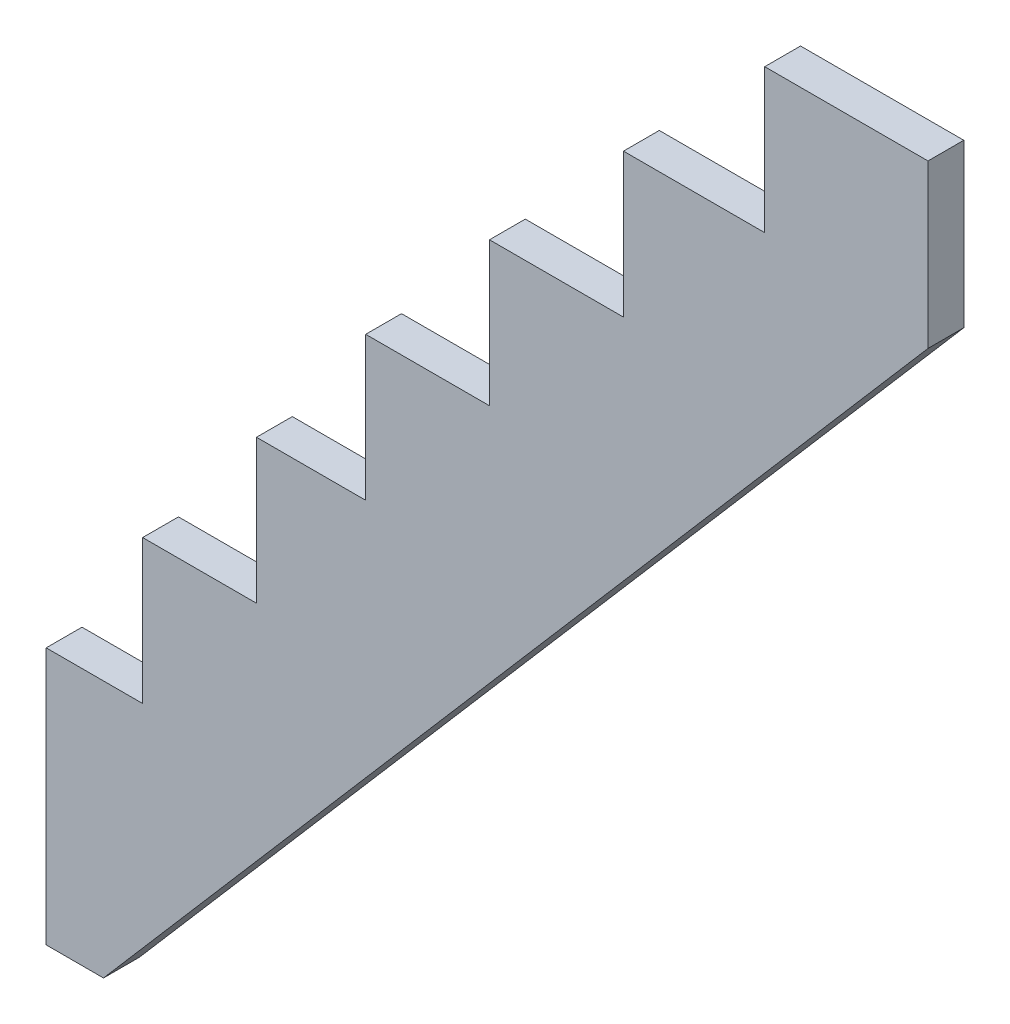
ISO-10303-21;
HEADER;
FILE_DESCRIPTION(('STEP AP214'),'2;1');
FILE_NAME('part.step','',(''),(''),'','','');
FILE_SCHEMA(('AUTOMOTIVE_DESIGN { 1 0 10303 214 1 1 1 1 }'));
ENDSEC;
DATA;
#1=APPLICATION_CONTEXT('core data for automotive mechanical design processes');
#2=APPLICATION_PROTOCOL_DEFINITION('international standard','automotive_design',2000,#1);
#3=PRODUCT_CONTEXT('',#1,'mechanical');
#4=PRODUCT('Part','Part','',(#3));
#5=PRODUCT_RELATED_PRODUCT_CATEGORY('part','',(#4));
#6=PRODUCT_DEFINITION_FORMATION('','',#4);
#7=PRODUCT_DEFINITION_CONTEXT('part definition',#1,'design');
#8=PRODUCT_DEFINITION('design','',#6,#7);
#9=PRODUCT_DEFINITION_SHAPE('','',#8);
#10=(LENGTH_UNIT() NAMED_UNIT(*) SI_UNIT(.MILLI.,.METRE.));
#11=(NAMED_UNIT(*) PLANE_ANGLE_UNIT() SI_UNIT($,.RADIAN.));
#12=(NAMED_UNIT(*) SI_UNIT($,.STERADIAN.) SOLID_ANGLE_UNIT());
#13=UNCERTAINTY_MEASURE_WITH_UNIT(LENGTH_MEASURE(1.E-05),#10,'distance_accuracy_value','');
#14=(GEOMETRIC_REPRESENTATION_CONTEXT(3) GLOBAL_UNCERTAINTY_ASSIGNED_CONTEXT((#13)) GLOBAL_UNIT_ASSIGNED_CONTEXT((#10,
#11,#12)) REPRESENTATION_CONTEXT('',''));
#15=CARTESIAN_POINT('',(0.,0.,0.));
#16=DIRECTION('',(0.,0.,1.));
#17=DIRECTION('',(1.,0.,0.));
#18=AXIS2_PLACEMENT_3D('',#15,#16,#17);
#19=CARTESIAN_POINT('',(-415.807218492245,-888.177713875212,50.));
#20=DIRECTION('',(-0.757764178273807,0.652528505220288,0.));
#21=DIRECTION('',(-0.652528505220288,-0.757764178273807,0.));
#22=AXIS2_PLACEMENT_3D('',#19,#20,#21);
#23=PLANE('',#22);
#24=DIRECTION('',(0.652528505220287,0.757764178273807,0.));
#25=VECTOR('',#24,1.);
#26=CARTESIAN_POINT('',(-415.807218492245,-888.177713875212,0.));
#27=LINE('',#26,#25);
#28=CARTESIAN_POINT('',(-1567.26797581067,-2225.33878439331,0.));
#29=VERTEX_POINT('',#28);
#30=CARTESIAN_POINT('',(-415.807218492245,-888.177713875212,0.));
#31=VERTEX_POINT('',#30);
#32=EDGE_CURVE('E153',#29,#31,#27,.T.);
#33=ORIENTED_EDGE('',*,*,#32,.T.);
#34=DIRECTION('',(0.,0.,-1.));
#35=VECTOR('',#34,1.);
#36=CARTESIAN_POINT('',(-415.807218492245,-888.177713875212,50.));
#37=LINE('',#36,#35);
#38=CARTESIAN_POINT('',(-415.807218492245,-888.177713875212,50.));
#39=VERTEX_POINT('',#38);
#40=EDGE_CURVE('E11',#39,#31,#37,.T.);
#41=ORIENTED_EDGE('',*,*,#40,.F.);
#42=DIRECTION('',(0.652528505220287,0.757764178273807,0.));
#43=VECTOR('',#42,1.);
#44=CARTESIAN_POINT('',(-415.807218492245,-888.177713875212,50.));
#45=LINE('',#44,#43);
#46=CARTESIAN_POINT('',(-1567.26797581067,-2225.33878439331,50.));
#47=VERTEX_POINT('',#46);
#48=EDGE_CURVE('E198',#47,#39,#45,.T.);
#49=ORIENTED_EDGE('',*,*,#48,.F.);
#50=DIRECTION('',(0.,0.,-1.));
#51=VECTOR('',#50,1.);
#52=CARTESIAN_POINT('',(-1567.26797581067,-2225.33878439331,50.));
#53=LINE('',#52,#51);
#54=EDGE_CURVE('E166',#47,#29,#53,.T.);
#55=ORIENTED_EDGE('',*,*,#54,.T.);
#56=EDGE_LOOP('',(#33,#41,#49,#55));
#57=FACE_BOUND('',#56,.T.);
#58=ADVANCED_FACE('F31',(#57),#23,.F.);
#59=CARTESIAN_POINT('',(-415.807218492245,-661.405142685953,50.));
#60=DIRECTION('',(-1.,0.,0.));
#61=DIRECTION('',(0.,-1.,0.));
#62=AXIS2_PLACEMENT_3D('',#59,#60,#61);
#63=PLANE('',#62);
#64=DIRECTION('',(0.,1.,0.));
#65=VECTOR('',#64,1.);
#66=CARTESIAN_POINT('',(-415.807218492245,-661.405142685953,0.));
#67=LINE('',#66,#65);
#68=CARTESIAN_POINT('',(-415.807218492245,-661.405142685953,0.));
#69=VERTEX_POINT('',#68);
#70=EDGE_CURVE('E149',#31,#69,#67,.T.);
#71=ORIENTED_EDGE('',*,*,#70,.T.);
#72=DIRECTION('',(0.,0.,-1.));
#73=VECTOR('',#72,1.);
#74=CARTESIAN_POINT('',(-415.807218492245,-661.405142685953,50.));
#75=LINE('',#74,#73);
#76=CARTESIAN_POINT('',(-415.807218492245,-661.405142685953,50.));
#77=VERTEX_POINT('',#76);
#78=EDGE_CURVE('E38',#77,#69,#75,.T.);
#79=ORIENTED_EDGE('',*,*,#78,.F.);
#80=DIRECTION('',(0.,1.,0.));
#81=VECTOR('',#80,1.);
#82=CARTESIAN_POINT('',(-415.807218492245,-661.405142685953,50.));
#83=LINE('',#82,#81);
#84=EDGE_CURVE('E162',#39,#77,#83,.T.);
#85=ORIENTED_EDGE('',*,*,#84,.F.);
#86=ORIENTED_EDGE('',*,*,#40,.T.);
#87=EDGE_LOOP('',(#71,#79,#85,#86));
#88=FACE_BOUND('',#87,.T.);
#89=ADVANCED_FACE('F161',(#88),#63,.F.);
#90=CARTESIAN_POINT('',(-415.807218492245,-661.405142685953,50.));
#91=DIRECTION('',(0.,-1.,0.));
#92=DIRECTION('',(0.,0.,-1.));
#93=AXIS2_PLACEMENT_3D('',#90,#91,#92);
#94=PLANE('',#93);
#95=DIRECTION('',(-1.,0.,0.));
#96=VECTOR('',#95,1.);
#97=CARTESIAN_POINT('',(-415.807218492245,-661.405142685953,0.));
#98=LINE('',#97,#96);
#99=CARTESIAN_POINT('',(-643.807218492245,-661.405142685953,0.));
#100=VERTEX_POINT('',#99);
#101=EDGE_CURVE('E155',#69,#100,#98,.T.);
#102=ORIENTED_EDGE('',*,*,#101,.T.);
#103=DIRECTION('',(0.,0.,-1.));
#104=VECTOR('',#103,1.);
#105=CARTESIAN_POINT('',(-643.807218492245,-661.405142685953,50.));
#106=LINE('',#105,#104);
#107=CARTESIAN_POINT('',(-643.807218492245,-661.405142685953,50.));
#108=VERTEX_POINT('',#107);
#109=EDGE_CURVE('E269',#108,#100,#106,.T.);
#110=ORIENTED_EDGE('',*,*,#109,.F.);
#111=DIRECTION('',(-1.,0.,0.));
#112=VECTOR('',#111,1.);
#113=CARTESIAN_POINT('',(-415.807218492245,-661.405142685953,50.));
#114=LINE('',#113,#112);
#115=EDGE_CURVE('E201',#77,#108,#114,.T.);
#116=ORIENTED_EDGE('',*,*,#115,.F.);
#117=ORIENTED_EDGE('',*,*,#78,.T.);
#118=EDGE_LOOP('',(#102,#110,#116,#117));
#119=FACE_BOUND('',#118,.T.);
#120=ADVANCED_FACE('F273',(#119),#94,.F.);
#121=CARTESIAN_POINT('',(-643.807218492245,-661.405142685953,50.));
#122=DIRECTION('',(1.,0.,0.));
#123=DIRECTION('',(0.,0.,-1.));
#124=AXIS2_PLACEMENT_3D('',#121,#122,#123);
#125=PLANE('',#124);
#126=DIRECTION('',(0.,-1.,0.));
#127=VECTOR('',#126,1.);
#128=CARTESIAN_POINT('',(-643.807218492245,-661.405142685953,0.));
#129=LINE('',#128,#127);
#130=CARTESIAN_POINT('',(-643.807218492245,-862.175142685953,0.));
#131=VERTEX_POINT('',#130);
#132=EDGE_CURVE('E170',#100,#131,#129,.T.);
#133=ORIENTED_EDGE('',*,*,#132,.T.);
#134=DIRECTION('',(0.,0.,-1.));
#135=VECTOR('',#134,1.);
#136=CARTESIAN_POINT('',(-643.807218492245,-862.175142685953,50.));
#137=LINE('',#136,#135);
#138=CARTESIAN_POINT('',(-643.807218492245,-862.175142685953,50.));
#139=VERTEX_POINT('',#138);
#140=EDGE_CURVE('E266',#139,#131,#137,.T.);
#141=ORIENTED_EDGE('',*,*,#140,.F.);
#142=DIRECTION('',(0.,-1.,0.));
#143=VECTOR('',#142,1.);
#144=CARTESIAN_POINT('',(-643.807218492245,-661.405142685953,50.));
#145=LINE('',#144,#143);
#146=EDGE_CURVE('E203',#108,#139,#145,.T.);
#147=ORIENTED_EDGE('',*,*,#146,.F.);
#148=ORIENTED_EDGE('',*,*,#109,.T.);
#149=EDGE_LOOP('',(#133,#141,#147,#148));
#150=FACE_BOUND('',#149,.T.);
#151=ADVANCED_FACE('F281',(#150),#125,.F.);
#152=CARTESIAN_POINT('',(-643.807218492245,-862.175142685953,50.));
#153=DIRECTION('',(0.,-1.,0.));
#154=DIRECTION('',(0.,0.,-1.));
#155=AXIS2_PLACEMENT_3D('',#152,#153,#154);
#156=PLANE('',#155);
#157=DIRECTION('',(-1.,0.,0.));
#158=VECTOR('',#157,1.);
#159=CARTESIAN_POINT('',(-643.807218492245,-862.175142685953,0.));
#160=LINE('',#159,#158);
#161=CARTESIAN_POINT('',(-841.084162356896,-862.175142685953,0.));
#162=VERTEX_POINT('',#161);
#163=EDGE_CURVE('E172',#131,#162,#160,.T.);
#164=ORIENTED_EDGE('',*,*,#163,.T.);
#165=DIRECTION('',(0.,0.,-1.));
#166=VECTOR('',#165,1.);
#167=CARTESIAN_POINT('',(-841.084162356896,-862.175142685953,50.));
#168=LINE('',#167,#166);
#169=CARTESIAN_POINT('',(-841.084162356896,-862.175142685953,50.));
#170=VERTEX_POINT('',#169);
#171=EDGE_CURVE('E263',#170,#162,#168,.T.);
#172=ORIENTED_EDGE('',*,*,#171,.F.);
#173=DIRECTION('',(-1.,0.,0.));
#174=VECTOR('',#173,1.);
#175=CARTESIAN_POINT('',(-643.807218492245,-862.175142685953,50.));
#176=LINE('',#175,#174);
#177=EDGE_CURVE('E205',#139,#170,#176,.T.);
#178=ORIENTED_EDGE('',*,*,#177,.F.);
#179=ORIENTED_EDGE('',*,*,#140,.T.);
#180=EDGE_LOOP('',(#164,#172,#178,#179));
#181=FACE_BOUND('',#180,.T.);
#182=ADVANCED_FACE('F284',(#181),#156,.F.);
#183=CARTESIAN_POINT('',(-841.084162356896,-862.175142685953,50.));
#184=DIRECTION('',(1.,0.,0.));
#185=DIRECTION('',(0.,0.,-1.));
#186=AXIS2_PLACEMENT_3D('',#183,#184,#185);
#187=PLANE('',#186);
#188=DIRECTION('',(0.,-1.,0.));
#189=VECTOR('',#188,1.);
#190=CARTESIAN_POINT('',(-841.084162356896,-862.175142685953,0.));
#191=LINE('',#190,#189);
#192=CARTESIAN_POINT('',(-841.084162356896,-1062.94514268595,0.));
#193=VERTEX_POINT('',#192);
#194=EDGE_CURVE('E174',#162,#193,#191,.T.);
#195=ORIENTED_EDGE('',*,*,#194,.T.);
#196=DIRECTION('',(0.,0.,-1.));
#197=VECTOR('',#196,1.);
#198=CARTESIAN_POINT('',(-841.084162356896,-1062.94514268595,50.));
#199=LINE('',#198,#197);
#200=CARTESIAN_POINT('',(-841.084162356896,-1062.94514268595,50.));
#201=VERTEX_POINT('',#200);
#202=EDGE_CURVE('E260',#201,#193,#199,.T.);
#203=ORIENTED_EDGE('',*,*,#202,.F.);
#204=DIRECTION('',(0.,-1.,0.));
#205=VECTOR('',#204,1.);
#206=CARTESIAN_POINT('',(-841.084162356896,-862.175142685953,50.));
#207=LINE('',#206,#205);
#208=EDGE_CURVE('E207',#170,#201,#207,.T.);
#209=ORIENTED_EDGE('',*,*,#208,.F.);
#210=ORIENTED_EDGE('',*,*,#171,.T.);
#211=EDGE_LOOP('',(#195,#203,#209,#210));
#212=FACE_BOUND('',#211,.T.);
#213=ADVANCED_FACE('F289',(#212),#187,.F.);
#214=CARTESIAN_POINT('',(-841.084162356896,-1062.94514268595,50.));
#215=DIRECTION('',(0.,-1.,0.));
#216=DIRECTION('',(0.,0.,-1.));
#217=AXIS2_PLACEMENT_3D('',#214,#215,#216);
#218=PLANE('',#217);
#219=DIRECTION('',(-1.,0.,0.));
#220=VECTOR('',#219,1.);
#221=CARTESIAN_POINT('',(-841.084162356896,-1062.94514268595,0.));
#222=LINE('',#221,#220);
#223=CARTESIAN_POINT('',(-1028.18867223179,-1062.94514268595,0.));
#224=VERTEX_POINT('',#223);
#225=EDGE_CURVE('E176',#193,#224,#222,.T.);
#226=ORIENTED_EDGE('',*,*,#225,.T.);
#227=DIRECTION('',(0.,0.,-1.));
#228=VECTOR('',#227,1.);
#229=CARTESIAN_POINT('',(-1028.18867223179,-1062.94514268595,50.));
#230=LINE('',#229,#228);
#231=CARTESIAN_POINT('',(-1028.18867223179,-1062.94514268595,50.));
#232=VERTEX_POINT('',#231);
#233=EDGE_CURVE('E257',#232,#224,#230,.T.);
#234=ORIENTED_EDGE('',*,*,#233,.F.);
#235=DIRECTION('',(-1.,0.,0.));
#236=VECTOR('',#235,1.);
#237=CARTESIAN_POINT('',(-841.084162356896,-1062.94514268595,50.));
#238=LINE('',#237,#236);
#239=EDGE_CURVE('E209',#201,#232,#238,.T.);
#240=ORIENTED_EDGE('',*,*,#239,.F.);
#241=ORIENTED_EDGE('',*,*,#202,.T.);
#242=EDGE_LOOP('',(#226,#234,#240,#241));
#243=FACE_BOUND('',#242,.T.);
#244=ADVANCED_FACE('F295',(#243),#218,.F.);
#245=CARTESIAN_POINT('',(-1028.18867223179,-1062.94514268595,50.));
#246=DIRECTION('',(1.,0.,0.));
#247=DIRECTION('',(0.,0.,-1.));
#248=AXIS2_PLACEMENT_3D('',#245,#246,#247);
#249=PLANE('',#248);
#250=DIRECTION('',(0.,-1.,0.));
#251=VECTOR('',#250,1.);
#252=CARTESIAN_POINT('',(-1028.18867223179,-1062.94514268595,0.));
#253=LINE('',#252,#251);
#254=CARTESIAN_POINT('',(-1028.18867223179,-1263.71514268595,0.));
#255=VERTEX_POINT('',#254);
#256=EDGE_CURVE('E178',#224,#255,#253,.T.);
#257=ORIENTED_EDGE('',*,*,#256,.T.);
#258=DIRECTION('',(0.,0.,-1.));
#259=VECTOR('',#258,1.);
#260=CARTESIAN_POINT('',(-1028.18867223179,-1263.71514268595,50.));
#261=LINE('',#260,#259);
#262=CARTESIAN_POINT('',(-1028.18867223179,-1263.71514268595,50.));
#263=VERTEX_POINT('',#262);
#264=EDGE_CURVE('E254',#263,#255,#261,.T.);
#265=ORIENTED_EDGE('',*,*,#264,.F.);
#266=DIRECTION('',(0.,-1.,0.));
#267=VECTOR('',#266,1.);
#268=CARTESIAN_POINT('',(-1028.18867223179,-1062.94514268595,50.));
#269=LINE('',#268,#267);
#270=EDGE_CURVE('E211',#232,#263,#269,.T.);
#271=ORIENTED_EDGE('',*,*,#270,.F.);
#272=ORIENTED_EDGE('',*,*,#233,.T.);
#273=EDGE_LOOP('',(#257,#265,#271,#272));
#274=FACE_BOUND('',#273,.T.);
#275=ADVANCED_FACE('F299',(#274),#249,.F.);
#276=CARTESIAN_POINT('',(-1028.18867223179,-1263.71514268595,50.));
#277=DIRECTION('',(0.,-1.,0.));
#278=DIRECTION('',(0.,0.,-1.));
#279=AXIS2_PLACEMENT_3D('',#276,#277,#278);
#280=PLANE('',#279);
#281=DIRECTION('',(-1.,0.,0.));
#282=VECTOR('',#281,1.);
#283=CARTESIAN_POINT('',(-1028.18867223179,-1263.71514268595,0.));
#284=LINE('',#283,#282);
#285=CARTESIAN_POINT('',(-1201.07642774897,-1263.71514268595,0.));
#286=VERTEX_POINT('',#285);
#287=EDGE_CURVE('E180',#255,#286,#284,.T.);
#288=ORIENTED_EDGE('',*,*,#287,.T.);
#289=DIRECTION('',(0.,0.,-1.));
#290=VECTOR('',#289,1.);
#291=CARTESIAN_POINT('',(-1201.07642774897,-1263.71514268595,50.));
#292=LINE('',#291,#290);
#293=CARTESIAN_POINT('',(-1201.07642774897,-1263.71514268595,50.));
#294=VERTEX_POINT('',#293);
#295=EDGE_CURVE('E251',#294,#286,#292,.T.);
#296=ORIENTED_EDGE('',*,*,#295,.F.);
#297=DIRECTION('',(-1.,0.,0.));
#298=VECTOR('',#297,1.);
#299=CARTESIAN_POINT('',(-1028.18867223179,-1263.71514268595,50.));
#300=LINE('',#299,#298);
#301=EDGE_CURVE('E213',#263,#294,#300,.T.);
#302=ORIENTED_EDGE('',*,*,#301,.F.);
#303=ORIENTED_EDGE('',*,*,#264,.T.);
#304=EDGE_LOOP('',(#288,#296,#302,#303));
#305=FACE_BOUND('',#304,.T.);
#306=ADVANCED_FACE('F304',(#305),#280,.F.);
#307=CARTESIAN_POINT('',(-1201.07642774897,-1263.71514268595,50.));
#308=DIRECTION('',(1.,0.,0.));
#309=DIRECTION('',(0.,0.,-1.));
#310=AXIS2_PLACEMENT_3D('',#307,#308,#309);
#311=PLANE('',#310);
#312=DIRECTION('',(0.,-1.,0.));
#313=VECTOR('',#312,1.);
#314=CARTESIAN_POINT('',(-1201.07642774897,-1263.71514268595,0.));
#315=LINE('',#314,#313);
#316=CARTESIAN_POINT('',(-1201.07642774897,-1464.48514268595,0.));
#317=VERTEX_POINT('',#316);
#318=EDGE_CURVE('E182',#286,#317,#315,.T.);
#319=ORIENTED_EDGE('',*,*,#318,.T.);
#320=DIRECTION('',(0.,0.,-1.));
#321=VECTOR('',#320,1.);
#322=CARTESIAN_POINT('',(-1201.07642774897,-1464.48514268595,50.));
#323=LINE('',#322,#321);
#324=CARTESIAN_POINT('',(-1201.07642774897,-1464.48514268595,50.));
#325=VERTEX_POINT('',#324);
#326=EDGE_CURVE('E248',#325,#317,#323,.T.);
#327=ORIENTED_EDGE('',*,*,#326,.F.);
#328=DIRECTION('',(0.,-1.,0.));
#329=VECTOR('',#328,1.);
#330=CARTESIAN_POINT('',(-1201.07642774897,-1263.71514268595,50.));
#331=LINE('',#330,#329);
#332=EDGE_CURVE('E215',#294,#325,#331,.T.);
#333=ORIENTED_EDGE('',*,*,#332,.F.);
#334=ORIENTED_EDGE('',*,*,#295,.T.);
#335=EDGE_LOOP('',(#319,#327,#333,#334));
#336=FACE_BOUND('',#335,.T.);
#337=ADVANCED_FACE('F310',(#336),#311,.F.);
#338=CARTESIAN_POINT('',(-1201.07642774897,-1464.48514268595,50.));
#339=DIRECTION('',(0.,-1.,0.));
#340=DIRECTION('',(0.,0.,-1.));
#341=AXIS2_PLACEMENT_3D('',#338,#339,#340);
#342=PLANE('',#341);
#343=DIRECTION('',(-1.,0.,0.));
#344=VECTOR('',#343,1.);
#345=CARTESIAN_POINT('',(-1201.07642774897,-1464.48514268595,0.));
#346=LINE('',#345,#344);
#347=CARTESIAN_POINT('',(-1353.58732874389,-1464.48514268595,0.));
#348=VERTEX_POINT('',#347);
#349=EDGE_CURVE('E184',#317,#348,#346,.T.);
#350=ORIENTED_EDGE('',*,*,#349,.T.);
#351=DIRECTION('',(0.,0.,-1.));
#352=VECTOR('',#351,1.);
#353=CARTESIAN_POINT('',(-1353.58732874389,-1464.48514268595,50.));
#354=LINE('',#353,#352);
#355=CARTESIAN_POINT('',(-1353.58732874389,-1464.48514268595,50.));
#356=VERTEX_POINT('',#355);
#357=EDGE_CURVE('E245',#356,#348,#354,.T.);
#358=ORIENTED_EDGE('',*,*,#357,.F.);
#359=DIRECTION('',(-1.,0.,0.));
#360=VECTOR('',#359,1.);
#361=CARTESIAN_POINT('',(-1201.07642774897,-1464.48514268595,50.));
#362=LINE('',#361,#360);
#363=EDGE_CURVE('E217',#325,#356,#362,.T.);
#364=ORIENTED_EDGE('',*,*,#363,.F.);
#365=ORIENTED_EDGE('',*,*,#326,.T.);
#366=EDGE_LOOP('',(#350,#358,#364,#365));
#367=FACE_BOUND('',#366,.T.);
#368=ADVANCED_FACE('F314',(#367),#342,.F.);
#369=CARTESIAN_POINT('',(-1353.58732874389,-1464.48514268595,50.));
#370=DIRECTION('',(1.,0.,0.));
#371=DIRECTION('',(0.,0.,-1.));
#372=AXIS2_PLACEMENT_3D('',#369,#370,#371);
#373=PLANE('',#372);
#374=DIRECTION('',(0.,-1.,0.));
#375=VECTOR('',#374,1.);
#376=CARTESIAN_POINT('',(-1353.58732874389,-1464.48514268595,0.));
#377=LINE('',#376,#375);
#378=CARTESIAN_POINT('',(-1353.58732874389,-1665.25514268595,0.));
#379=VERTEX_POINT('',#378);
#380=EDGE_CURVE('E186',#348,#379,#377,.T.);
#381=ORIENTED_EDGE('',*,*,#380,.T.);
#382=DIRECTION('',(0.,0.,-1.));
#383=VECTOR('',#382,1.);
#384=CARTESIAN_POINT('',(-1353.58732874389,-1665.25514268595,50.));
#385=LINE('',#384,#383);
#386=CARTESIAN_POINT('',(-1353.58732874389,-1665.25514268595,50.));
#387=VERTEX_POINT('',#386);
#388=EDGE_CURVE('E242',#387,#379,#385,.T.);
#389=ORIENTED_EDGE('',*,*,#388,.F.);
#390=DIRECTION('',(0.,-1.,0.));
#391=VECTOR('',#390,1.);
#392=CARTESIAN_POINT('',(-1353.58732874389,-1464.48514268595,50.));
#393=LINE('',#392,#391);
#394=EDGE_CURVE('E219',#356,#387,#393,.T.);
#395=ORIENTED_EDGE('',*,*,#394,.F.);
#396=ORIENTED_EDGE('',*,*,#357,.T.);
#397=EDGE_LOOP('',(#381,#389,#395,#396));
#398=FACE_BOUND('',#397,.T.);
#399=ADVANCED_FACE('F319',(#398),#373,.F.);
#400=CARTESIAN_POINT('',(-1353.58732874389,-1665.25514268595,50.));
#401=DIRECTION('',(0.,-1.,0.));
#402=DIRECTION('',(0.,0.,-1.));
#403=AXIS2_PLACEMENT_3D('',#400,#401,#402);
#404=PLANE('',#403);
#405=DIRECTION('',(-1.,0.,0.));
#406=VECTOR('',#405,1.);
#407=CARTESIAN_POINT('',(-1353.58732874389,-1665.25514268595,0.));
#408=LINE('',#407,#406);
#409=CARTESIAN_POINT('',(-1512.55666923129,-1665.25514268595,0.));
#410=VERTEX_POINT('',#409);
#411=EDGE_CURVE('E188',#379,#410,#408,.T.);
#412=ORIENTED_EDGE('',*,*,#411,.T.);
#413=DIRECTION('',(0.,0.,-1.));
#414=VECTOR('',#413,1.);
#415=CARTESIAN_POINT('',(-1512.55666923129,-1665.25514268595,50.));
#416=LINE('',#415,#414);
#417=CARTESIAN_POINT('',(-1512.55666923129,-1665.25514268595,50.));
#418=VERTEX_POINT('',#417);
#419=EDGE_CURVE('E239',#418,#410,#416,.T.);
#420=ORIENTED_EDGE('',*,*,#419,.F.);
#421=DIRECTION('',(-1.,0.,0.));
#422=VECTOR('',#421,1.);
#423=CARTESIAN_POINT('',(-1353.58732874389,-1665.25514268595,50.));
#424=LINE('',#423,#422);
#425=EDGE_CURVE('E221',#387,#418,#424,.T.);
#426=ORIENTED_EDGE('',*,*,#425,.F.);
#427=ORIENTED_EDGE('',*,*,#388,.T.);
#428=EDGE_LOOP('',(#412,#420,#426,#427));
#429=FACE_BOUND('',#428,.T.);
#430=ADVANCED_FACE('F325',(#429),#404,.F.);
#431=CARTESIAN_POINT('',(-1512.55666923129,-1665.25514268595,50.));
#432=DIRECTION('',(1.,0.,0.));
#433=DIRECTION('',(0.,0.,-1.));
#434=AXIS2_PLACEMENT_3D('',#431,#432,#433);
#435=PLANE('',#434);
#436=DIRECTION('',(0.,-1.,0.));
#437=VECTOR('',#436,1.);
#438=CARTESIAN_POINT('',(-1512.55666923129,-1665.25514268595,0.));
#439=LINE('',#438,#437);
#440=CARTESIAN_POINT('',(-1512.55666923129,-1866.02514268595,0.));
#441=VERTEX_POINT('',#440);
#442=EDGE_CURVE('E190',#410,#441,#439,.T.);
#443=ORIENTED_EDGE('',*,*,#442,.T.);
#444=DIRECTION('',(0.,0.,-1.));
#445=VECTOR('',#444,1.);
#446=CARTESIAN_POINT('',(-1512.55666923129,-1866.02514268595,50.));
#447=LINE('',#446,#445);
#448=CARTESIAN_POINT('',(-1512.55666923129,-1866.02514268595,50.));
#449=VERTEX_POINT('',#448);
#450=EDGE_CURVE('E236',#449,#441,#447,.T.);
#451=ORIENTED_EDGE('',*,*,#450,.F.);
#452=DIRECTION('',(0.,-1.,0.));
#453=VECTOR('',#452,1.);
#454=CARTESIAN_POINT('',(-1512.55666923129,-1665.25514268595,50.));
#455=LINE('',#454,#453);
#456=EDGE_CURVE('E223',#418,#449,#455,.T.);
#457=ORIENTED_EDGE('',*,*,#456,.F.);
#458=ORIENTED_EDGE('',*,*,#419,.T.);
#459=EDGE_LOOP('',(#443,#451,#457,#458));
#460=FACE_BOUND('',#459,.T.);
#461=ADVANCED_FACE('F329',(#460),#435,.F.);
#462=CARTESIAN_POINT('',(-1512.55666923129,-1866.02514268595,50.));
#463=DIRECTION('',(0.,-1.,0.));
#464=DIRECTION('',(1.,0.,0.));
#465=AXIS2_PLACEMENT_3D('',#462,#463,#464);
#466=PLANE('',#465);
#467=DIRECTION('',(-1.,0.,0.));
#468=VECTOR('',#467,1.);
#469=CARTESIAN_POINT('',(-1512.55666923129,-1866.02514268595,0.));
#470=LINE('',#469,#468);
#471=CARTESIAN_POINT('',(-1647.26797581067,-1866.02514268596,0.));
#472=VERTEX_POINT('',#471);
#473=EDGE_CURVE('E192',#441,#472,#470,.T.);
#474=ORIENTED_EDGE('',*,*,#473,.T.);
#475=DIRECTION('',(0.,0.,-1.));
#476=VECTOR('',#475,1.);
#477=CARTESIAN_POINT('',(-1647.26797581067,-1866.02514268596,50.));
#478=LINE('',#477,#476);
#479=CARTESIAN_POINT('',(-1647.26797581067,-1866.02514268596,50.));
#480=VERTEX_POINT('',#479);
#481=EDGE_CURVE('E233',#480,#472,#478,.T.);
#482=ORIENTED_EDGE('',*,*,#481,.F.);
#483=DIRECTION('',(-1.,0.,0.));
#484=VECTOR('',#483,1.);
#485=CARTESIAN_POINT('',(-1512.55666923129,-1866.02514268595,50.));
#486=LINE('',#485,#484);
#487=EDGE_CURVE('E225',#449,#480,#486,.T.);
#488=ORIENTED_EDGE('',*,*,#487,.F.);
#489=ORIENTED_EDGE('',*,*,#450,.T.);
#490=EDGE_LOOP('',(#474,#482,#488,#489));
#491=FACE_BOUND('',#490,.T.);
#492=ADVANCED_FACE('F334',(#491),#466,.F.);
#493=CARTESIAN_POINT('',(-1647.26797581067,-1866.02514268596,50.));
#494=DIRECTION('',(1.,0.,0.));
#495=DIRECTION('',(0.,0.,-1.));
#496=AXIS2_PLACEMENT_3D('',#493,#494,#495);
#497=PLANE('',#496);
#498=DIRECTION('',(0.,-1.,0.));
#499=VECTOR('',#498,1.);
#500=CARTESIAN_POINT('',(-1647.26797581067,-1866.02514268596,0.));
#501=LINE('',#500,#499);
#502=CARTESIAN_POINT('',(-1647.26797581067,-2225.33878439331,0.));
#503=VERTEX_POINT('',#502);
#504=EDGE_CURVE('E194',#472,#503,#501,.T.);
#505=ORIENTED_EDGE('',*,*,#504,.T.);
#506=DIRECTION('',(0.,0.,-1.));
#507=VECTOR('',#506,1.);
#508=CARTESIAN_POINT('',(-1647.26797581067,-2225.33878439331,50.));
#509=LINE('',#508,#507);
#510=CARTESIAN_POINT('',(-1647.26797581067,-2225.33878439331,50.));
#511=VERTEX_POINT('',#510);
#512=EDGE_CURVE('E230',#511,#503,#509,.T.);
#513=ORIENTED_EDGE('',*,*,#512,.F.);
#514=DIRECTION('',(0.,-1.,0.));
#515=VECTOR('',#514,1.);
#516=CARTESIAN_POINT('',(-1647.26797581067,-1866.02514268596,50.));
#517=LINE('',#516,#515);
#518=EDGE_CURVE('E50',#480,#511,#517,.T.);
#519=ORIENTED_EDGE('',*,*,#518,.F.);
#520=ORIENTED_EDGE('',*,*,#481,.T.);
#521=EDGE_LOOP('',(#505,#513,#519,#520));
#522=FACE_BOUND('',#521,.T.);
#523=ADVANCED_FACE('F337',(#522),#497,.F.);
#524=CARTESIAN_POINT('',(-1567.26797581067,-2225.33878439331,50.));
#525=DIRECTION('',(0.,1.,0.));
#526=DIRECTION('',(0.,0.,1.));
#527=AXIS2_PLACEMENT_3D('',#524,#525,#526);
#528=PLANE('',#527);
#529=DIRECTION('',(1.,0.,0.));
#530=VECTOR('',#529,1.);
#531=CARTESIAN_POINT('',(-1567.26797581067,-2225.33878439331,0.));
#532=LINE('',#531,#530);
#533=EDGE_CURVE('E196',#503,#29,#532,.T.);
#534=ORIENTED_EDGE('',*,*,#533,.T.);
#535=ORIENTED_EDGE('',*,*,#54,.F.);
#536=DIRECTION('',(1.,0.,0.));
#537=VECTOR('',#536,1.);
#538=CARTESIAN_POINT('',(-1567.26797581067,-2225.33878439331,50.));
#539=LINE('',#538,#537);
#540=EDGE_CURVE('E45',#511,#47,#539,.T.);
#541=ORIENTED_EDGE('',*,*,#540,.F.);
#542=ORIENTED_EDGE('',*,*,#512,.T.);
#543=EDGE_LOOP('',(#534,#535,#541,#542));
#544=FACE_BOUND('',#543,.T.);
#545=ADVANCED_FACE('F339',(#544),#528,.F.);
#546=CARTESIAN_POINT('',(-1567.26797581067,-2225.33878439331,50.));
#547=DIRECTION('',(0.,0.,-1.));
#548=DIRECTION('',(-1.,0.,0.));
#549=AXIS2_PLACEMENT_3D('',#546,#547,#548);
#550=PLANE('',#549);
#551=ORIENTED_EDGE('',*,*,#48,.T.);
#552=ORIENTED_EDGE('',*,*,#84,.T.);
#553=ORIENTED_EDGE('',*,*,#115,.T.);
#554=ORIENTED_EDGE('',*,*,#146,.T.);
#555=ORIENTED_EDGE('',*,*,#177,.T.);
#556=ORIENTED_EDGE('',*,*,#208,.T.);
#557=ORIENTED_EDGE('',*,*,#239,.T.);
#558=ORIENTED_EDGE('',*,*,#270,.T.);
#559=ORIENTED_EDGE('',*,*,#301,.T.);
#560=ORIENTED_EDGE('',*,*,#332,.T.);
#561=ORIENTED_EDGE('',*,*,#363,.T.);
#562=ORIENTED_EDGE('',*,*,#394,.T.);
#563=ORIENTED_EDGE('',*,*,#425,.T.);
#564=ORIENTED_EDGE('',*,*,#456,.T.);
#565=ORIENTED_EDGE('',*,*,#487,.T.);
#566=ORIENTED_EDGE('',*,*,#518,.T.);
#567=ORIENTED_EDGE('',*,*,#540,.T.);
#568=EDGE_LOOP('',(#551,#552,#553,#554,#555,#556,#557,#558,#559,#560,#561,#562,#563,#564,#565,
#566,#567));
#569=FACE_BOUND('',#568,.T.);
#570=ADVANCED_FACE('F276',(#569),#550,.F.);
#571=CARTESIAN_POINT('',(-1567.26797581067,-2225.33878439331,0.));
#572=DIRECTION('',(0.,0.,-1.));
#573=DIRECTION('',(-1.,0.,0.));
#574=AXIS2_PLACEMENT_3D('',#571,#572,#573);
#575=PLANE('',#574);
#576=ORIENTED_EDGE('',*,*,#32,.F.);
#577=ORIENTED_EDGE('',*,*,#533,.F.);
#578=ORIENTED_EDGE('',*,*,#504,.F.);
#579=ORIENTED_EDGE('',*,*,#473,.F.);
#580=ORIENTED_EDGE('',*,*,#442,.F.);
#581=ORIENTED_EDGE('',*,*,#411,.F.);
#582=ORIENTED_EDGE('',*,*,#380,.F.);
#583=ORIENTED_EDGE('',*,*,#349,.F.);
#584=ORIENTED_EDGE('',*,*,#318,.F.);
#585=ORIENTED_EDGE('',*,*,#287,.F.);
#586=ORIENTED_EDGE('',*,*,#256,.F.);
#587=ORIENTED_EDGE('',*,*,#225,.F.);
#588=ORIENTED_EDGE('',*,*,#194,.F.);
#589=ORIENTED_EDGE('',*,*,#163,.F.);
#590=ORIENTED_EDGE('',*,*,#132,.F.);
#591=ORIENTED_EDGE('',*,*,#101,.F.);
#592=ORIENTED_EDGE('',*,*,#70,.F.);
#593=EDGE_LOOP('',(#576,#577,#578,#579,#580,#581,#582,#583,#584,#585,#586,#587,#588,#589,#590,
#591,#592));
#594=FACE_BOUND('',#593,.T.);
#595=ADVANCED_FACE('F150',(#594),#575,.T.);
#596=CLOSED_SHELL('',(#58,#89,#120,#151,#182,#213,#244,#275,#306,#337,#368,#399,#430,#461,#492,
#523,#545,#570,#595));
#597=MANIFOLD_SOLID_BREP('B2',#596);
#598=ADVANCED_BREP_SHAPE_REPRESENTATION('',(#18,#597),#14);
#599=SHAPE_DEFINITION_REPRESENTATION(#9,#598);
ENDSEC;
END-ISO-10303-21;
